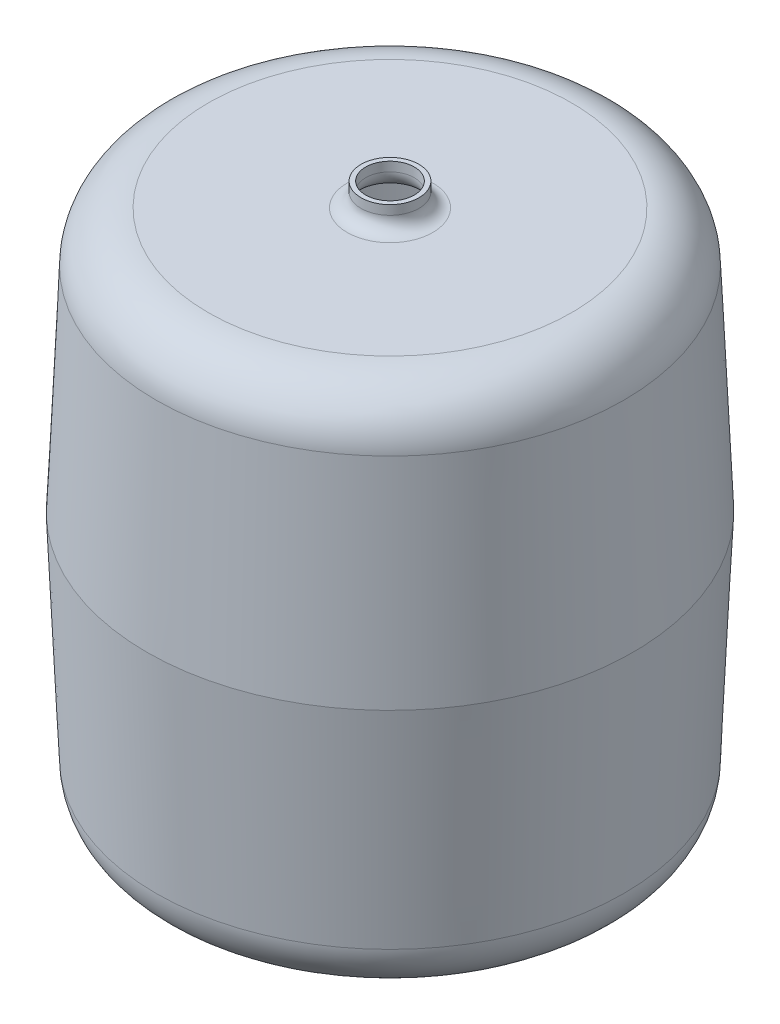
ISO-10303-21;
HEADER;
FILE_DESCRIPTION(('STEP AP214'),'2;1');
FILE_NAME('part.step','',(''),(''),'','','');
FILE_SCHEMA(('AUTOMOTIVE_DESIGN { 1 0 10303 214 1 1 1 1 }'));
ENDSEC;
DATA;
#1=APPLICATION_CONTEXT('core data for automotive mechanical design processes');
#2=APPLICATION_PROTOCOL_DEFINITION('international standard','automotive_design',2000,#1);
#3=PRODUCT_CONTEXT('',#1,'mechanical');
#4=PRODUCT('Part','Part','',(#3));
#5=PRODUCT_RELATED_PRODUCT_CATEGORY('part','',(#4));
#6=PRODUCT_DEFINITION_FORMATION('','',#4);
#7=PRODUCT_DEFINITION_CONTEXT('part definition',#1,'design');
#8=PRODUCT_DEFINITION('design','',#6,#7);
#9=PRODUCT_DEFINITION_SHAPE('','',#8);
#10=(LENGTH_UNIT() NAMED_UNIT(*) SI_UNIT(.MILLI.,.METRE.));
#11=(NAMED_UNIT(*) PLANE_ANGLE_UNIT() SI_UNIT($,.RADIAN.));
#12=(NAMED_UNIT(*) SI_UNIT($,.STERADIAN.) SOLID_ANGLE_UNIT());
#13=UNCERTAINTY_MEASURE_WITH_UNIT(LENGTH_MEASURE(1.E-05),#10,'distance_accuracy_value','');
#14=(GEOMETRIC_REPRESENTATION_CONTEXT(3) GLOBAL_UNCERTAINTY_ASSIGNED_CONTEXT((#13)) GLOBAL_UNIT_ASSIGNED_CONTEXT((#10,
#11,#12)) REPRESENTATION_CONTEXT('',''));
#15=CARTESIAN_POINT('',(0.,0.,0.));
#16=DIRECTION('',(0.,0.,1.));
#17=DIRECTION('',(1.,0.,0.));
#18=AXIS2_PLACEMENT_3D('',#15,#16,#17);
#19=CARTESIAN_POINT('',(0.,-475.,0.));
#20=DIRECTION('',(0.,-1.,0.));
#21=DIRECTION('',(0.,0.,-1.));
#22=AXIS2_PLACEMENT_3D('',#19,#20,#21);
#23=PLANE('',#22);
#24=CARTESIAN_POINT('',(0.,-475.,0.));
#25=DIRECTION('',(0.,1.,0.));
#26=DIRECTION('',(0.,0.,1.));
#27=AXIS2_PLACEMENT_3D('',#24,#25,#26);
#28=CIRCLE('',#27,156.921871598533);
#29=CARTESIAN_POINT('',(0.,-475.,156.921871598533));
#30=VERTEX_POINT('',#29);
#31=EDGE_CURVE('E10',#30,#30,#28,.T.);
#32=ORIENTED_EDGE('',*,*,#31,.F.);
#33=EDGE_LOOP('',(#32));
#34=FACE_BOUND('',#33,.T.);
#35=ADVANCED_FACE('F37',(#34),#23,.T.);
#36=CARTESIAN_POINT('',(0.,-430.,0.));
#37=DIRECTION('',(0.,1.,0.));
#38=DIRECTION('',(0.,0.,1.));
#39=AXIS2_PLACEMENT_3D('',#36,#37,#38);
#40=TOROIDAL_SURFACE('',#39,156.921871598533,45.);
#41=ORIENTED_EDGE('',*,*,#31,.T.);
#42=EDGE_LOOP('',(#41));
#43=FACE_BOUND('',#42,.T.);
#44=CARTESIAN_POINT('',(0.,-431.96287243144,0.));
#45=DIRECTION('',(0.,1.,0.));
#46=DIRECTION('',(0.,0.,1.));
#47=AXIS2_PLACEMENT_3D('',#44,#45,#46);
#48=CIRCLE('',#47,201.879041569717);
#49=CARTESIAN_POINT('',(0.,-431.96287243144,201.879041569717));
#50=VERTEX_POINT('',#49);
#51=EDGE_CURVE('E44',#50,#50,#48,.T.);
#52=ORIENTED_EDGE('',*,*,#51,.F.);
#53=EDGE_LOOP('',(#52));
#54=FACE_BOUND('',#53,.T.);
#55=ADVANCED_FACE('F125',(#43,#54),#40,.T.);
#56=CARTESIAN_POINT('',(0.,-247.5,0.));
#57=DIRECTION('',(0.,1.,0.));
#58=DIRECTION('',(0.,0.,1.));
#59=AXIS2_PLACEMENT_3D('',#56,#57,#58);
#60=CONICAL_SURFACE('',#59,209.932864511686,0.0436332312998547);
#61=ORIENTED_EDGE('',*,*,#51,.T.);
#62=EDGE_LOOP('',(#61));
#63=FACE_BOUND('',#62,.T.);
#64=CARTESIAN_POINT('',(0.,-247.5,0.));
#65=DIRECTION('',(0.,1.,0.));
#66=DIRECTION('',(0.,0.,1.));
#67=AXIS2_PLACEMENT_3D('',#64,#65,#66);
#68=CIRCLE('',#67,209.932864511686);
#69=CARTESIAN_POINT('',(0.,-247.5,209.932864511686));
#70=VERTEX_POINT('',#69);
#71=EDGE_CURVE('E49',#70,#70,#68,.T.);
#72=ORIENTED_EDGE('',*,*,#71,.F.);
#73=EDGE_LOOP('',(#72));
#74=FACE_BOUND('',#73,.T.);
#75=ADVANCED_FACE('F130',(#63,#74),#60,.T.);
#76=CARTESIAN_POINT('',(0.,-63.0371275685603,0.));
#77=DIRECTION('',(0.,-1.,0.));
#78=DIRECTION('',(0.,0.,-1.));
#79=AXIS2_PLACEMENT_3D('',#76,#77,#78);
#80=CONICAL_SURFACE('',#79,201.879041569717,0.0436332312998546);
#81=ORIENTED_EDGE('',*,*,#71,.T.);
#82=EDGE_LOOP('',(#81));
#83=FACE_BOUND('',#82,.T.);
#84=CARTESIAN_POINT('',(0.,-63.0371275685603,0.));
#85=DIRECTION('',(0.,1.,0.));
#86=DIRECTION('',(0.,0.,1.));
#87=AXIS2_PLACEMENT_3D('',#84,#85,#86);
#88=CIRCLE('',#87,201.879041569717);
#89=CARTESIAN_POINT('',(0.,-63.0371275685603,201.879041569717));
#90=VERTEX_POINT('',#89);
#91=EDGE_CURVE('E54',#90,#90,#88,.T.);
#92=ORIENTED_EDGE('',*,*,#91,.F.);
#93=EDGE_LOOP('',(#92));
#94=FACE_BOUND('',#93,.T.);
#95=ADVANCED_FACE('F134',(#83,#94),#80,.T.);
#96=CARTESIAN_POINT('',(0.,-65.,0.));
#97=DIRECTION('',(0.,1.,0.));
#98=DIRECTION('',(0.,0.,1.));
#99=AXIS2_PLACEMENT_3D('',#96,#97,#98);
#100=TOROIDAL_SURFACE('',#99,156.921871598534,45.);
#101=ORIENTED_EDGE('',*,*,#91,.T.);
#102=EDGE_LOOP('',(#101));
#103=FACE_BOUND('',#102,.T.);
#104=CARTESIAN_POINT('',(0.,-20.,0.));
#105=DIRECTION('',(0.,1.,0.));
#106=DIRECTION('',(0.,0.,1.));
#107=AXIS2_PLACEMENT_3D('',#104,#105,#106);
#108=CIRCLE('',#107,156.921871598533);
#109=CARTESIAN_POINT('',(0.,-20.,156.921871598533));
#110=VERTEX_POINT('',#109);
#111=EDGE_CURVE('E60',#110,#110,#108,.T.);
#112=ORIENTED_EDGE('',*,*,#111,.F.);
#113=EDGE_LOOP('',(#112));
#114=FACE_BOUND('',#113,.T.);
#115=ADVANCED_FACE('F140',(#103,#114),#100,.T.);
#116=CARTESIAN_POINT('',(-156.921871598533,-20.,0.));
#117=DIRECTION('',(0.,1.,0.));
#118=DIRECTION('',(0.,0.,1.));
#119=AXIS2_PLACEMENT_3D('',#116,#117,#118);
#120=PLANE('',#119);
#121=ORIENTED_EDGE('',*,*,#111,.T.);
#122=EDGE_LOOP('',(#121));
#123=FACE_BOUND('',#122,.T.);
#124=CARTESIAN_POINT('',(0.,-20.,0.));
#125=DIRECTION('',(0.,1.,0.));
#126=DIRECTION('',(0.,0.,1.));
#127=AXIS2_PLACEMENT_3D('',#124,#125,#126);
#128=CIRCLE('',#127,37.0000000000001);
#129=CARTESIAN_POINT('',(0.,-20.,37.0000000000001));
#130=VERTEX_POINT('',#129);
#131=EDGE_CURVE('E64',#130,#130,#128,.T.);
#132=ORIENTED_EDGE('',*,*,#131,.F.);
#133=EDGE_LOOP('',(#132));
#134=FACE_BOUND('',#133,.T.);
#135=ADVANCED_FACE('F144',(#123,#134),#120,.T.);
#136=CARTESIAN_POINT('',(0.,-8.00000000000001,0.));
#137=DIRECTION('',(0.,1.,0.));
#138=DIRECTION('',(0.,0.,1.));
#139=AXIS2_PLACEMENT_3D('',#136,#137,#138);
#140=TOROIDAL_SURFACE('',#139,37.0000000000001,12.);
#141=ORIENTED_EDGE('',*,*,#131,.T.);
#142=EDGE_LOOP('',(#141));
#143=FACE_BOUND('',#142,.T.);
#144=CARTESIAN_POINT('',(0.,-8.00000000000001,0.));
#145=DIRECTION('',(0.,1.,0.));
#146=DIRECTION('',(0.,0.,1.));
#147=AXIS2_PLACEMENT_3D('',#144,#145,#146);
#148=CIRCLE('',#147,25.0000000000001);
#149=CARTESIAN_POINT('',(0.,-8.00000000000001,25.0000000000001));
#150=VERTEX_POINT('',#149);
#151=EDGE_CURVE('E68',#150,#150,#148,.T.);
#152=ORIENTED_EDGE('',*,*,#151,.F.);
#153=EDGE_LOOP('',(#152));
#154=FACE_BOUND('',#153,.T.);
#155=ADVANCED_FACE('F148',(#143,#154),#140,.F.);
#156=CARTESIAN_POINT('',(0.,-471.,0.));
#157=DIRECTION('',(0.,1.,0.));
#158=DIRECTION('',(0.,0.,1.));
#159=AXIS2_PLACEMENT_3D('',#156,#157,#158);
#160=CYLINDRICAL_SURFACE('',#159,25.0000000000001);
#161=ORIENTED_EDGE('',*,*,#151,.T.);
#162=EDGE_LOOP('',(#161));
#163=FACE_BOUND('',#162,.T.);
#164=CARTESIAN_POINT('',(0.,0.,0.));
#165=DIRECTION('',(0.,1.,0.));
#166=DIRECTION('',(0.,0.,1.));
#167=AXIS2_PLACEMENT_3D('',#164,#165,#166);
#168=CIRCLE('',#167,25.0000000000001);
#169=CARTESIAN_POINT('',(0.,0.,25.0000000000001));
#170=VERTEX_POINT('',#169);
#171=EDGE_CURVE('E72',#170,#170,#168,.T.);
#172=ORIENTED_EDGE('',*,*,#171,.F.);
#173=EDGE_LOOP('',(#172));
#174=FACE_BOUND('',#173,.T.);
#175=ADVANCED_FACE('F152',(#163,#174),#160,.T.);
#176=CARTESIAN_POINT('',(-25.,0.,0.));
#177=DIRECTION('',(0.,1.,0.));
#178=DIRECTION('',(0.,0.,1.));
#179=AXIS2_PLACEMENT_3D('',#176,#177,#178);
#180=PLANE('',#179);
#181=ORIENTED_EDGE('',*,*,#171,.T.);
#182=EDGE_LOOP('',(#181));
#183=FACE_BOUND('',#182,.T.);
#184=CARTESIAN_POINT('',(0.,0.,0.));
#185=DIRECTION('',(0.,1.,0.));
#186=DIRECTION('',(0.,0.,1.));
#187=AXIS2_PLACEMENT_3D('',#184,#185,#186);
#188=CIRCLE('',#187,21.0000000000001);
#189=CARTESIAN_POINT('',(0.,0.,21.0000000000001));
#190=VERTEX_POINT('',#189);
#191=EDGE_CURVE('E76',#190,#190,#188,.T.);
#192=ORIENTED_EDGE('',*,*,#191,.F.);
#193=EDGE_LOOP('',(#192));
#194=FACE_BOUND('',#193,.T.);
#195=ADVANCED_FACE('F156',(#183,#194),#180,.T.);
#196=CARTESIAN_POINT('',(0.,-471.,0.));
#197=DIRECTION('',(0.,1.,0.));
#198=DIRECTION('',(0.,0.,1.));
#199=AXIS2_PLACEMENT_3D('',#196,#197,#198);
#200=CYLINDRICAL_SURFACE('',#199,21.0000000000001);
#201=ORIENTED_EDGE('',*,*,#191,.T.);
#202=EDGE_LOOP('',(#201));
#203=FACE_BOUND('',#202,.T.);
#204=CARTESIAN_POINT('',(0.,-8.00000000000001,0.));
#205=DIRECTION('',(0.,1.,0.));
#206=DIRECTION('',(0.,0.,1.));
#207=AXIS2_PLACEMENT_3D('',#204,#205,#206);
#208=CIRCLE('',#207,21.0000000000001);
#209=CARTESIAN_POINT('',(0.,-8.00000000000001,21.0000000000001));
#210=VERTEX_POINT('',#209);
#211=EDGE_CURVE('E80',#210,#210,#208,.T.);
#212=ORIENTED_EDGE('',*,*,#211,.F.);
#213=EDGE_LOOP('',(#212));
#214=FACE_BOUND('',#213,.T.);
#215=ADVANCED_FACE('F160',(#203,#214),#200,.F.);
#216=CARTESIAN_POINT('',(0.,-8.00000000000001,0.));
#217=DIRECTION('',(0.,1.,0.));
#218=DIRECTION('',(0.,0.,1.));
#219=AXIS2_PLACEMENT_3D('',#216,#217,#218);
#220=TOROIDAL_SURFACE('',#219,37.0000000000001,16.);
#221=ORIENTED_EDGE('',*,*,#211,.T.);
#222=EDGE_LOOP('',(#221));
#223=FACE_BOUND('',#222,.T.);
#224=CARTESIAN_POINT('',(0.,-24.,0.));
#225=DIRECTION('',(0.,1.,0.));
#226=DIRECTION('',(0.,0.,1.));
#227=AXIS2_PLACEMENT_3D('',#224,#225,#226);
#228=CIRCLE('',#227,37.0000000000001);
#229=CARTESIAN_POINT('',(0.,-24.,37.0000000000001));
#230=VERTEX_POINT('',#229);
#231=EDGE_CURVE('E84',#230,#230,#228,.T.);
#232=ORIENTED_EDGE('',*,*,#231,.F.);
#233=EDGE_LOOP('',(#232));
#234=FACE_BOUND('',#233,.T.);
#235=ADVANCED_FACE('F164',(#223,#234),#220,.T.);
#236=CARTESIAN_POINT('',(-156.921871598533,-24.,0.));
#237=DIRECTION('',(0.,-1.,0.));
#238=DIRECTION('',(0.,0.,-1.));
#239=AXIS2_PLACEMENT_3D('',#236,#237,#238);
#240=PLANE('',#239);
#241=ORIENTED_EDGE('',*,*,#231,.T.);
#242=EDGE_LOOP('',(#241));
#243=FACE_BOUND('',#242,.T.);
#244=CARTESIAN_POINT('',(0.,-24.,0.));
#245=DIRECTION('',(0.,1.,0.));
#246=DIRECTION('',(0.,0.,1.));
#247=AXIS2_PLACEMENT_3D('',#244,#245,#246);
#248=CIRCLE('',#247,156.921871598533);
#249=CARTESIAN_POINT('',(0.,-24.,156.921871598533));
#250=VERTEX_POINT('',#249);
#251=EDGE_CURVE('E88',#250,#250,#248,.T.);
#252=ORIENTED_EDGE('',*,*,#251,.F.);
#253=EDGE_LOOP('',(#252));
#254=FACE_BOUND('',#253,.T.);
#255=ADVANCED_FACE('F168',(#243,#254),#240,.T.);
#256=CARTESIAN_POINT('',(0.,-65.,0.));
#257=DIRECTION('',(0.,1.,0.));
#258=DIRECTION('',(0.,0.,1.));
#259=AXIS2_PLACEMENT_3D('',#256,#257,#258);
#260=TOROIDAL_SURFACE('',#259,156.921871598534,41.);
#261=ORIENTED_EDGE('',*,*,#251,.T.);
#262=EDGE_LOOP('',(#261));
#263=FACE_BOUND('',#262,.T.);
#264=CARTESIAN_POINT('',(0.,-63.2116051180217,0.));
#265=DIRECTION('',(0.,1.,0.));
#266=DIRECTION('',(0.,0.,1.));
#267=AXIS2_PLACEMENT_3D('',#264,#265,#266);
#268=CIRCLE('',#267,197.88284868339);
#269=CARTESIAN_POINT('',(0.,-63.2116051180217,197.88284868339));
#270=VERTEX_POINT('',#269);
#271=EDGE_CURVE('E92',#270,#270,#268,.T.);
#272=ORIENTED_EDGE('',*,*,#271,.F.);
#273=EDGE_LOOP('',(#272));
#274=FACE_BOUND('',#273,.T.);
#275=ADVANCED_FACE('F172',(#263,#274),#260,.F.);
#276=CARTESIAN_POINT('',(0.,-247.5,0.));
#277=DIRECTION('',(0.,-1.,0.));
#278=DIRECTION('',(0.,0.,-1.));
#279=AXIS2_PLACEMENT_3D('',#276,#277,#278);
#280=CONICAL_SURFACE('',#279,205.929053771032,0.0436332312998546);
#281=ORIENTED_EDGE('',*,*,#271,.T.);
#282=EDGE_LOOP('',(#281));
#283=FACE_BOUND('',#282,.T.);
#284=CARTESIAN_POINT('',(0.,-247.5,0.));
#285=DIRECTION('',(0.,1.,0.));
#286=DIRECTION('',(0.,0.,1.));
#287=AXIS2_PLACEMENT_3D('',#284,#285,#286);
#288=CIRCLE('',#287,205.929053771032);
#289=CARTESIAN_POINT('',(0.,-247.5,205.929053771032));
#290=VERTEX_POINT('',#289);
#291=EDGE_CURVE('E96',#290,#290,#288,.T.);
#292=ORIENTED_EDGE('',*,*,#291,.F.);
#293=EDGE_LOOP('',(#292));
#294=FACE_BOUND('',#293,.T.);
#295=ADVANCED_FACE('F121',(#283,#294),#280,.F.);
#296=CARTESIAN_POINT('',(0.,-431.788394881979,0.));
#297=DIRECTION('',(0.,1.,0.));
#298=DIRECTION('',(0.,0.,1.));
#299=AXIS2_PLACEMENT_3D('',#296,#297,#298);
#300=CONICAL_SURFACE('',#299,197.88284868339,0.0436332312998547);
#301=ORIENTED_EDGE('',*,*,#291,.T.);
#302=EDGE_LOOP('',(#301));
#303=FACE_BOUND('',#302,.T.);
#304=CARTESIAN_POINT('',(0.,-431.788394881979,0.));
#305=DIRECTION('',(0.,1.,0.));
#306=DIRECTION('',(0.,0.,1.));
#307=AXIS2_PLACEMENT_3D('',#304,#305,#306);
#308=CIRCLE('',#307,197.88284868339);
#309=CARTESIAN_POINT('',(0.,-431.788394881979,197.88284868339));
#310=VERTEX_POINT('',#309);
#311=EDGE_CURVE('E100',#310,#310,#308,.T.);
#312=ORIENTED_EDGE('',*,*,#311,.F.);
#313=EDGE_LOOP('',(#312));
#314=FACE_BOUND('',#313,.T.);
#315=ADVANCED_FACE('F113',(#303,#314),#300,.F.);
#316=CARTESIAN_POINT('',(0.,-430.,0.));
#317=DIRECTION('',(0.,1.,0.));
#318=DIRECTION('',(0.,0.,1.));
#319=AXIS2_PLACEMENT_3D('',#316,#317,#318);
#320=TOROIDAL_SURFACE('',#319,156.921871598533,41.);
#321=ORIENTED_EDGE('',*,*,#311,.T.);
#322=EDGE_LOOP('',(#321));
#323=FACE_BOUND('',#322,.T.);
#324=CARTESIAN_POINT('',(0.,-471.,0.));
#325=DIRECTION('',(0.,1.,0.));
#326=DIRECTION('',(0.,0.,1.));
#327=AXIS2_PLACEMENT_3D('',#324,#325,#326);
#328=CIRCLE('',#327,156.921871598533);
#329=CARTESIAN_POINT('',(0.,-471.,156.921871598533));
#330=VERTEX_POINT('',#329);
#331=EDGE_CURVE('E104',#330,#330,#328,.T.);
#332=ORIENTED_EDGE('',*,*,#331,.F.);
#333=EDGE_LOOP('',(#332));
#334=FACE_BOUND('',#333,.T.);
#335=ADVANCED_FACE('F111',(#323,#334),#320,.F.);
#336=CARTESIAN_POINT('',(0.,-471.,0.));
#337=DIRECTION('',(0.,1.,0.));
#338=DIRECTION('',(0.,0.,1.));
#339=AXIS2_PLACEMENT_3D('',#336,#337,#338);
#340=PLANE('',#339);
#341=ORIENTED_EDGE('',*,*,#331,.T.);
#342=EDGE_LOOP('',(#341));
#343=FACE_BOUND('',#342,.T.);
#344=ADVANCED_FACE('F109',(#343),#340,.T.);
#345=CLOSED_SHELL('',(#35,#55,#75,#95,#115,#135,#155,#175,#195,#215,#235,#255,#275,#295,#315,
#335,#344));
#346=MANIFOLD_SOLID_BREP('B2',#345);
#347=ADVANCED_BREP_SHAPE_REPRESENTATION('',(#18,#346),#14);
#348=SHAPE_DEFINITION_REPRESENTATION(#9,#347);
ENDSEC;
END-ISO-10303-21;
